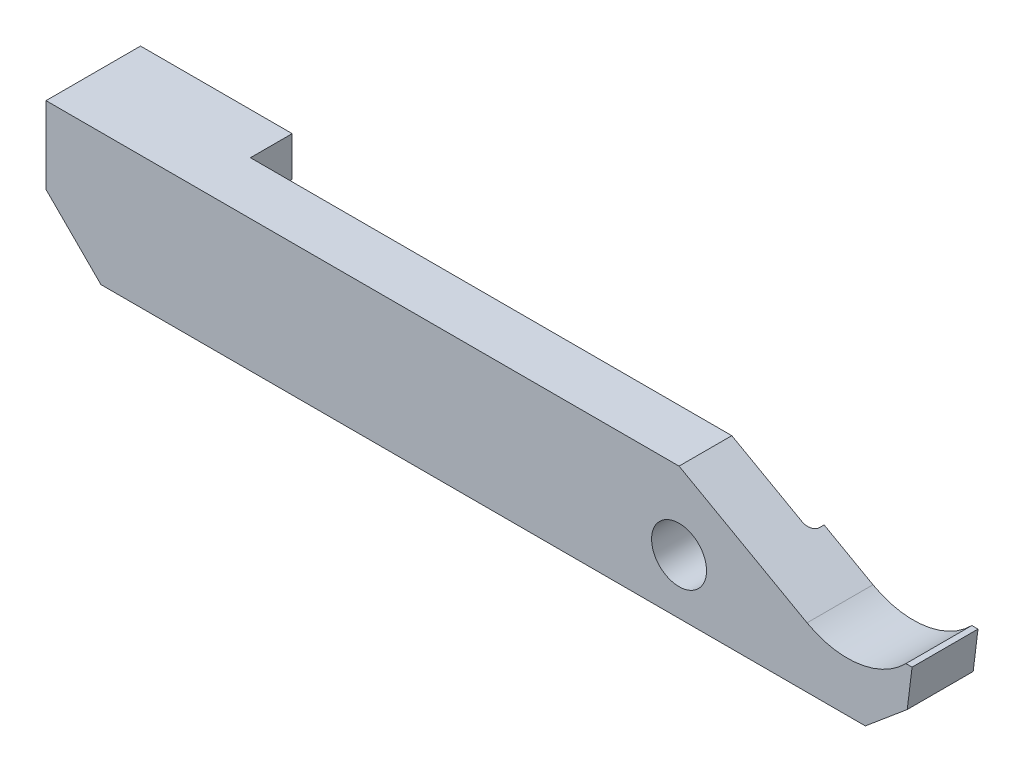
from build123d import *

# Parameters (mm, degrees)
SKETCH1_R           = 1.5875
BOSS_EXTRUDE1_DEPTH = 3.81
CUT_EXTRUDE1_DEPTH  = 51.758072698
BOSS_EXTRUDE2_START = -3.048
SKETCH3_W           = 8.763
SKETCH3_H           = 2.286
BOSS_EXTRUDE2_DEPTH = 5.461


with BuildPart() as part:
    # Sketch1 → Boss-Extrude1 (new body)
    with BuildSketch(Plane.XY):
        with BuildLine():
            ThreePointArc((43.970770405, 3.476379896), (46.964595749, 2.917973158), (49.682169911, 4.2926))
            Line((49.682169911, 4.2926), (50.038, 4.2926))
            Line((50.038, 4.2926), (49.760433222, 2.032))
            Line((49.760433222, 2.032), (47.338789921, 0))
            Line((47.338789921, 0), (3.175, 0))
            Line((3.175, 0), (0, 3.175))
            Line((0, 3.175), (0, 7.62))
            Line((0, 7.62), (36.576, 7.62))
            Line((36.576, 7.62), (43.970770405, 3.476379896))
        make_face()
        with Locations((36.576, 3.175)):
            Circle(SKETCH1_R, mode=Mode.SUBTRACT)
    extrude(amount=-BOSS_EXTRUDE1_DEPTH)

    # Sketch2 → Cut-Extrude1 (cut, through all)
    with BuildSketch(Plane(origin=(0, 7.62, 0), x_dir=(1, 0, 0), z_dir=(0, 1, 0))):
        with BuildLine():
            Line((0, 3.048), (40.64, 3.048))
            ThreePointArc((40.64, 3.048), (40.999210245, 3.196789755), (41.148, 3.556))
            Line((41.148, 3.556), (41.148, 5.588))
            Line((41.148, 5.588), (0, 5.588))
            Line((0, 5.588), (0, 3.048))
        make_face()
    extrude(amount=-CUT_EXTRUDE1_DEPTH, mode=Mode.SUBTRACT)

    # Sketch3 → Boss-Extrude2 (add)
    with BuildSketch(Plane(origin=(0, 0, -3.048), x_dir=(-1, 0, 0), z_dir=(0, 0, -1)).offset(BOSS_EXTRUDE2_START)):
        with Locations((-4.3815, 6.477)):
            Rectangle(SKETCH3_W, SKETCH3_H)
    extrude(amount=BOSS_EXTRUDE2_DEPTH)


solid = part.part
